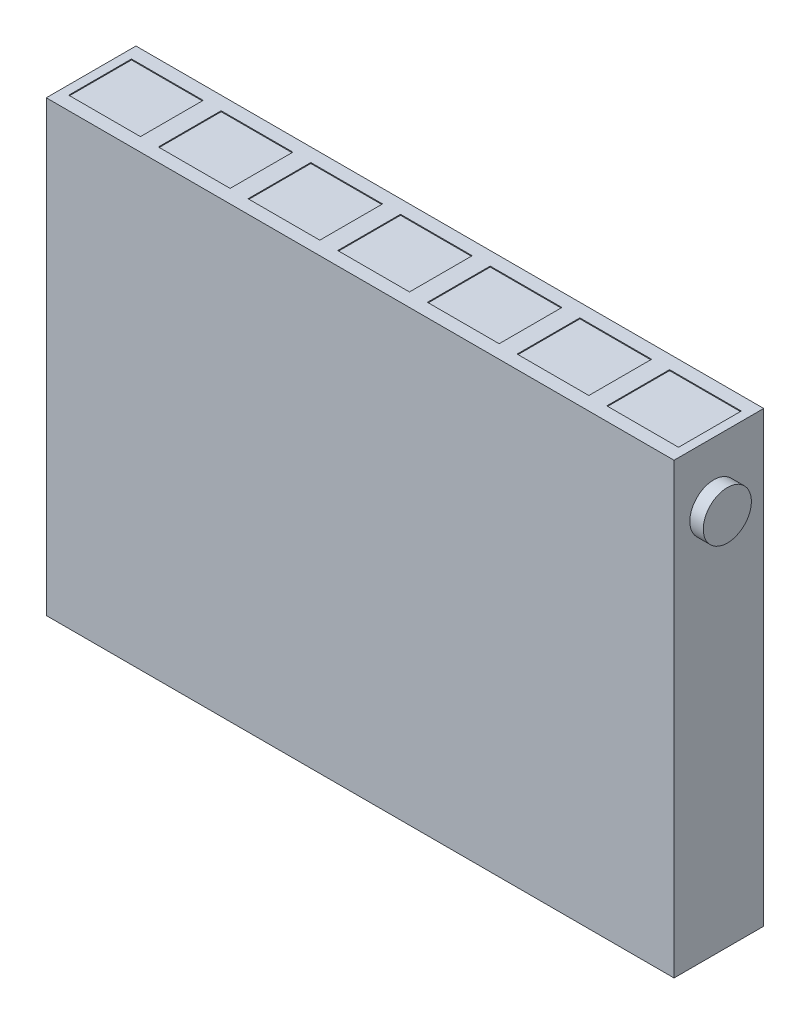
from build123d import *

# Parameters (mm, degrees)
ESQUISSE1_W             = 700
ESQUISSE1_H             = 500
BOSS_EXTRU_1_DEPTH      = 100
ESQUISSE2_R             = 26.821333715
BOSS_EXTRU_2_DEPTH      = 15
ESQUISSE3_W             = 80
ESQUISSE3_H             = 70
ENL_V_MAT_EXTRU_1_DEPTH = 1


with BuildPart() as part:
    # Esquisse1 → Boss.-Extru.1 (new body)
    with BuildSketch(Plane.XY):
        Rectangle(ESQUISSE1_W, ESQUISSE1_H)
    extrude(amount=BOSS_EXTRU_1_DEPTH)

    # Esquisse2 → Boss.-Extru.2 (add)
    with BuildSketch(Plane(origin=(350, 0, 0), x_dir=(0, 0, -1), z_dir=(1, 0, 0))):
        with Locations(Location((-55.58469048, 182.141362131, 0), (0, 0, 180))):
            Circle(ESQUISSE2_R)
    extrude(amount=BOSS_EXTRU_2_DEPTH)

    # Esquisse3 → Enl_v. mat.-Extru.1 (cut)
    with BuildSketch(Plane(origin=(0, 250, 0), x_dir=(1, 0, 0), z_dir=(0, 1, 0))):
        with Locations((-300, -50)):
            Rectangle(ESQUISSE3_W, ESQUISSE3_H)
        with Locations((-200, -50)):
            Rectangle(ESQUISSE3_W, ESQUISSE3_H)
        with Locations((-100, -50)):
            Rectangle(ESQUISSE3_W, ESQUISSE3_H)
        with Locations((0, -50)):
            Rectangle(ESQUISSE3_W, ESQUISSE3_H)
        with Locations((100, -50)):
            Rectangle(ESQUISSE3_W, ESQUISSE3_H)
        with Locations((200, -50)):
            Rectangle(ESQUISSE3_W, ESQUISSE3_H)
        with Locations((300, -50)):
            Rectangle(ESQUISSE3_W, ESQUISSE3_H)
    extrude(amount=-ENL_V_MAT_EXTRU_1_DEPTH, mode=Mode.SUBTRACT)


solid = part.part
